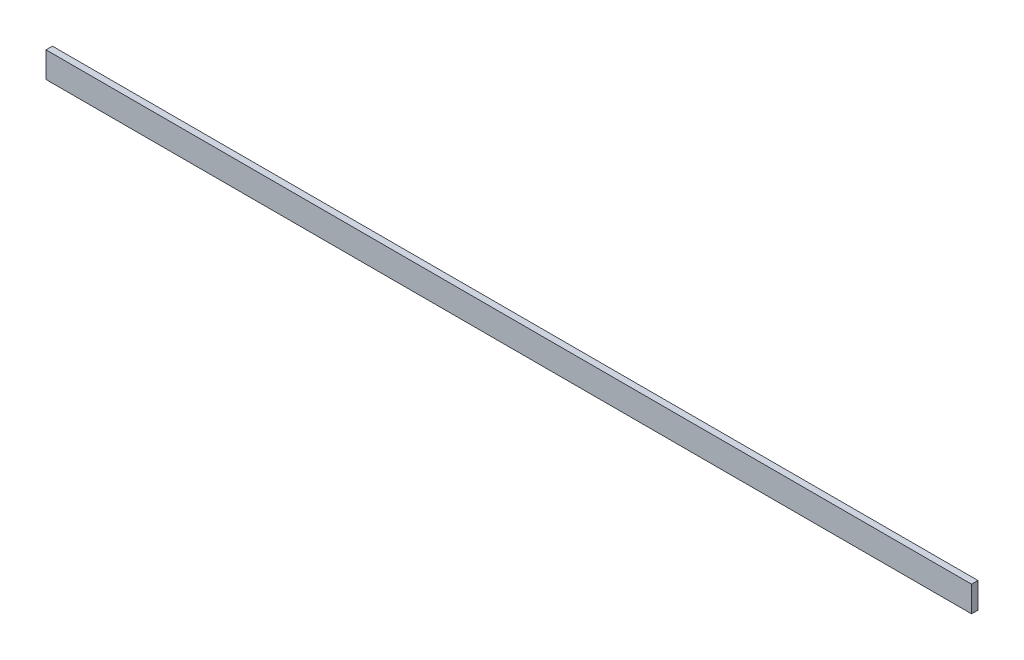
from build123d import *

# Parameters (mm, degrees)
SKETCH1_W            = 12.7
SKETCH1_H            = 3.175
PANEL_OR_BLOCK_DEPTH = 457.2


with BuildPart() as part:
    # Sketch1 → Panel_or_block (new body)
    with BuildSketch(Plane.YZ):
        with Locations((0, 1.5875)):
            Rectangle(SKETCH1_W, SKETCH1_H)
    extrude(amount=PANEL_OR_BLOCK_DEPTH)


solid = part.part
